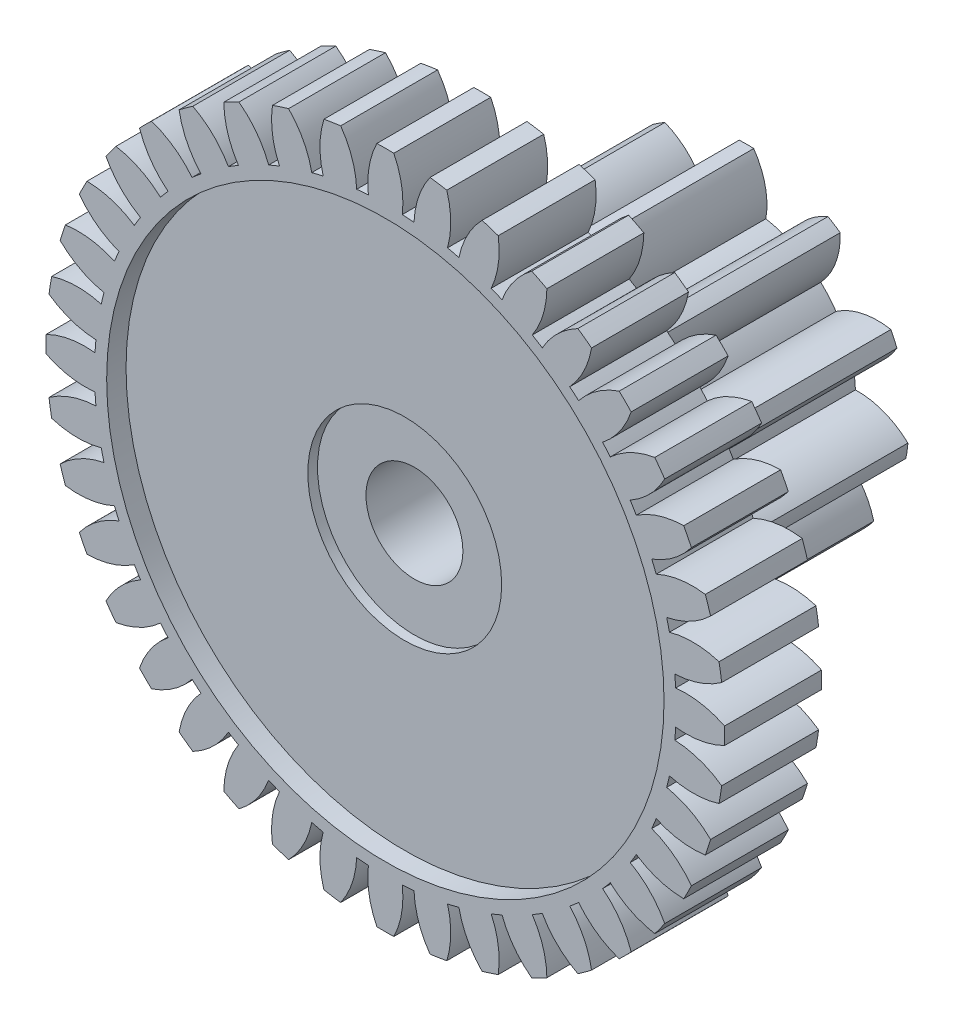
from build123d import *

# Parameters (mm, degrees)
SKETCH1_R          = 6
EXTRUDE1_DEPTH     = 1
EXTRUDE2_DEPTH     = 1
CIRPATTERN1_COUNT  = 40
SKETCH3_R          = 5.75
SKETCH3_R_2        = 2
CUT_EXTRUDE1_DEPTH = 0.4
SKETCH4_R          = 2.25
EXTRUDE3_DEPTH     = 5.85
EXTRUDE4_START     = -5.85
EXTRUDE4_DEPTH     = 5.85
CIRPATTERN2_COUNT  = 11
SKETCH5_R          = 1
CUT_EXTRUDE2_DEPTH = 7.45
SKETCH7_R          = 2
CUT_EXTRUDE3_DEPTH = 0.6


with BuildPart() as part:
    # Sketch1 → Extrude1 (new, symmetric)
    with BuildSketch(Plane.XY):
        Circle(SKETCH1_R)
    extrude(amount=EXTRUDE1_DEPTH, both=True)

    # Sketch2 → Extrude2 (add, symmetric)
    with BuildSketch(Plane.XY):
        with BuildLine():
            ThreePointArc((-5.989782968, 0.35), (-6, 0), (-5.989782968, -0.35))
            ThreePointArc((-5.989782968, -0.35), (-6.506492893, -0.335627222), (-6.997812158, -0.175))
            ThreePointArc((-6.997812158, -0.175), (-7, 0), (-6.997812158, 0.175))
            ThreePointArc((-6.997812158, 0.175), (-6.506492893, 0.335627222), (-5.989782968, 0.35))
        make_face()
    extrude2 = extrude(amount=EXTRUDE2_DEPTH, both=True)

    # CirPattern1: Extrude2 ×40 about axis
    cirpattern1_axis = Axis((0, 0, 0), (0, 0, 1))
    for i in range(1, CIRPATTERN1_COUNT):
        add(extrude2.rotate(cirpattern1_axis, i * 360 / CIRPATTERN1_COUNT))

    # Sketch3 → Cut-Extrude1 (cut)
    with BuildSketch(Plane(origin=(0, 0, -1), x_dir=(-1, 0, 0), z_dir=(0, 0, -1))):
        Circle(SKETCH3_R)
        Circle(SKETCH3_R_2, mode=Mode.SUBTRACT)
    cut_extrude1 = extrude(amount=-CUT_EXTRUDE1_DEPTH, mode=Mode.SUBTRACT)

    # Mirror1: Cut-Extrude1 across plane
    add(cut_extrude1.mirror(Plane.XY), mode=Mode.SUBTRACT)

    # Sketch4 → Extrude3 (add)
    with BuildSketch(Plane(origin=(0, 0, -0.6), x_dir=(-1, 0, 0), z_dir=(0, 0, -1))):
        Circle(SKETCH4_R)
    extrude3 = extrude(amount=EXTRUDE3_DEPTH)

    # Sketch6 → Extrude4 (add)
    with BuildSketch(Plane(origin=(0, 0, -6.45), x_dir=(-1, 0, 0), z_dir=(0, 0, -1)).offset(EXTRUDE4_START)):
        with BuildLine():
            ThreePointArc((0.149956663, 3.344365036), (0, 3.348693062), (-0.149956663, 3.344365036))
            ThreePointArc((-0.149956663, 3.344365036), (-0.387165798, 2.804082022), (-0.4, 2.214158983))
            ThreePointArc((-0.4, 2.214158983), (0, 2.25), (0.4, 2.214158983))
            ThreePointArc((0.4, 2.214158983), (0.387165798, 2.804082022), (0.149956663, 3.344365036))
        make_face()
    extrude4 = extrude(amount=EXTRUDE4_DEPTH)

    # CirPattern2: Extrude3, Extrude4 ×11 about axis
    cirpattern2_axis = Axis((0, 0, 0), (0, 0, 1))
    add([extrude3.rotate(cirpattern2_axis, i * 360 / CIRPATTERN2_COUNT) for i in range(1, CIRPATTERN2_COUNT)])
    add([extrude4.rotate(cirpattern2_axis, i * 360 / CIRPATTERN2_COUNT) for i in range(1, CIRPATTERN2_COUNT)])

    # Sketch5 → Cut-Extrude2 (cut)
    with BuildSketch(Plane(origin=(0, 0, -6.45), x_dir=(-1, 0, 0), z_dir=(0, 0, -1))):
        Circle(SKETCH5_R)
    extrude(amount=-CUT_EXTRUDE2_DEPTH, mode=Mode.SUBTRACT)

    # Sketch7 → Cut-Extrude3 (cut)
    with BuildSketch(Plane.XY.offset(1)):
        Circle(SKETCH7_R)
    extrude(amount=-CUT_EXTRUDE3_DEPTH, mode=Mode.SUBTRACT)


solid = part.part
